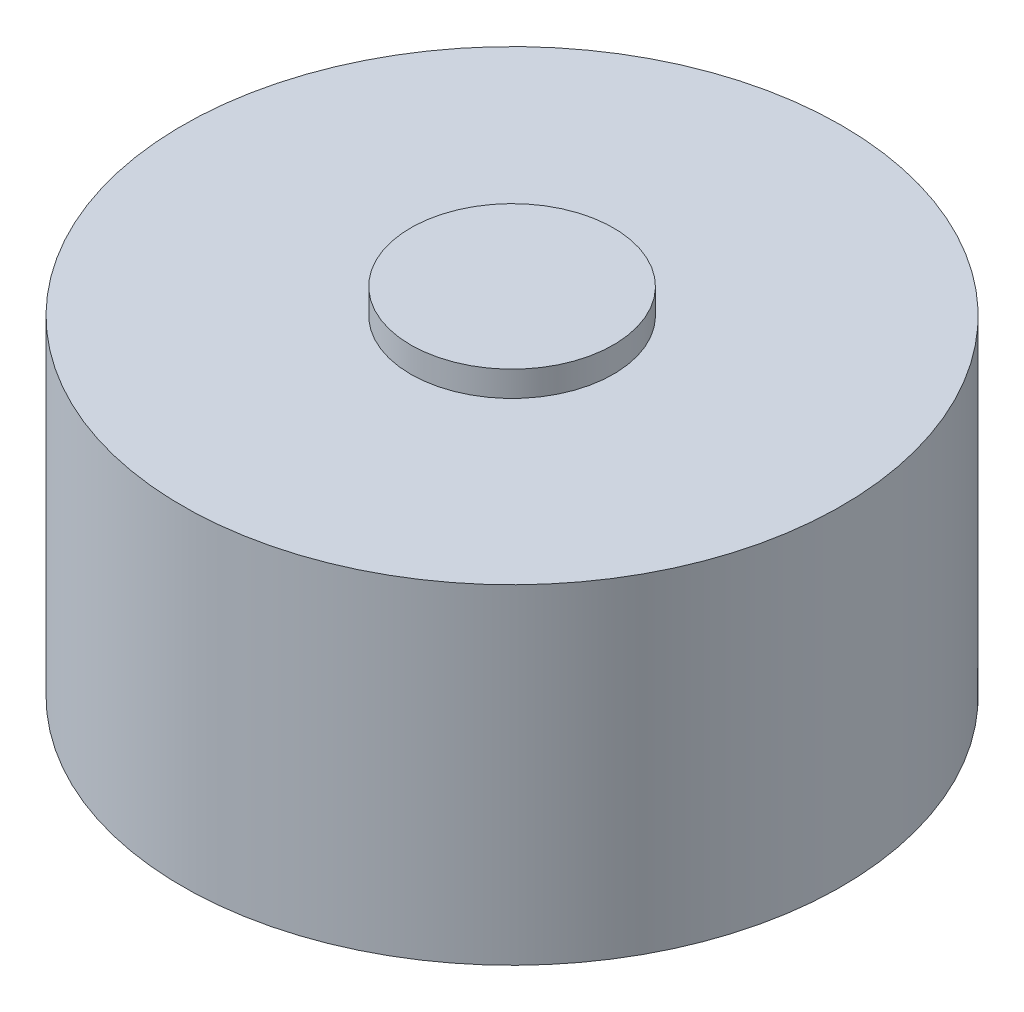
from build123d import *

# Parameters (mm, degrees)
SKETCH1_R           = 6.5
BOSS_EXTRUDE1_DEPTH = 6.5
SKETCH2_R           = 2
BOSS_EXTRUDE2_DEPTH = 0.5


with BuildPart() as part:
    # Sketch1 → Boss-Extrude1 (new body)
    with BuildSketch(Plane(origin=(0, 0, 0), x_dir=(1, 0, 0), z_dir=(0, 1, 0))):
        with Locations(Location((0, 0, 0), (0, 0, 90))):
            Circle(SKETCH1_R)
    extrude(amount=BOSS_EXTRUDE1_DEPTH)

    # Sketch2 → Boss-Extrude2 (add)
    with BuildSketch(Plane(origin=(0, 6.5, 0), x_dir=(1, 0, 0), z_dir=(0, 1, 0))):
        with Locations(Location((0, 0, 0), (0, 0, 270))):
            Circle(SKETCH2_R)
    extrude(amount=BOSS_EXTRUDE2_DEPTH)


solid = part.part
